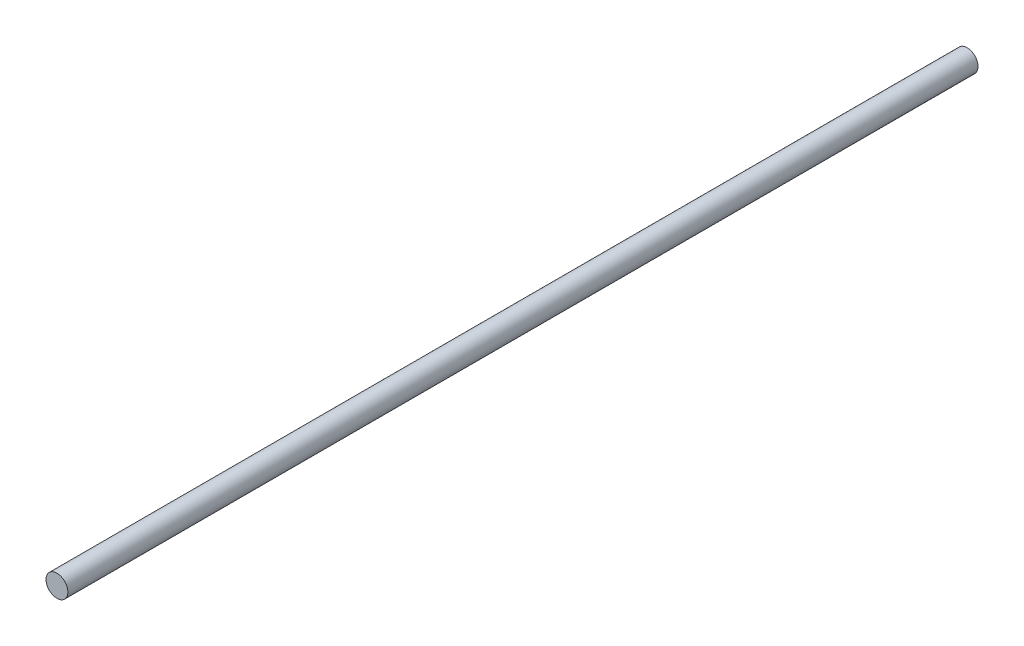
ISO-10303-21;
HEADER;
FILE_DESCRIPTION(('STEP AP214'),'2;1');
FILE_NAME('part.step','',(''),(''),'','','');
FILE_SCHEMA(('AUTOMOTIVE_DESIGN { 1 0 10303 214 1 1 1 1 }'));
ENDSEC;
DATA;
#1=APPLICATION_CONTEXT('core data for automotive mechanical design processes');
#2=APPLICATION_PROTOCOL_DEFINITION('international standard','automotive_design',2000,#1);
#3=PRODUCT_CONTEXT('',#1,'mechanical');
#4=PRODUCT('Part','Part','',(#3));
#5=PRODUCT_RELATED_PRODUCT_CATEGORY('part','',(#4));
#6=PRODUCT_DEFINITION_FORMATION('','',#4);
#7=PRODUCT_DEFINITION_CONTEXT('part definition',#1,'design');
#8=PRODUCT_DEFINITION('design','',#6,#7);
#9=PRODUCT_DEFINITION_SHAPE('','',#8);
#10=(LENGTH_UNIT() NAMED_UNIT(*) SI_UNIT(.MILLI.,.METRE.));
#11=(NAMED_UNIT(*) PLANE_ANGLE_UNIT() SI_UNIT($,.RADIAN.));
#12=(NAMED_UNIT(*) SI_UNIT($,.STERADIAN.) SOLID_ANGLE_UNIT());
#13=UNCERTAINTY_MEASURE_WITH_UNIT(LENGTH_MEASURE(1.E-05),#10,'distance_accuracy_value','');
#14=(GEOMETRIC_REPRESENTATION_CONTEXT(3) GLOBAL_UNCERTAINTY_ASSIGNED_CONTEXT((#13)) GLOBAL_UNIT_ASSIGNED_CONTEXT((#10,
#11,#12)) REPRESENTATION_CONTEXT('',''));
#15=CARTESIAN_POINT('',(0.,0.,0.));
#16=DIRECTION('',(0.,0.,1.));
#17=DIRECTION('',(1.,0.,0.));
#18=AXIS2_PLACEMENT_3D('',#15,#16,#17);
#19=CARTESIAN_POINT('',(0.,0.,990.));
#20=DIRECTION('',(0.,0.,-1.));
#21=DIRECTION('',(-1.,0.,0.));
#22=AXIS2_PLACEMENT_3D('',#19,#20,#21);
#23=CYLINDRICAL_SURFACE('',#22,12.);
#24=CARTESIAN_POINT('',(0.,0.,0.));
#25=DIRECTION('',(0.,0.,-1.));
#26=DIRECTION('',(-1.,0.,0.));
#27=AXIS2_PLACEMENT_3D('',#24,#25,#26);
#28=CIRCLE('',#27,12.);
#29=CARTESIAN_POINT('',(-12.,0.,0.));
#30=VERTEX_POINT('',#29);
#31=EDGE_CURVE('E8',#30,#30,#28,.T.);
#32=ORIENTED_EDGE('',*,*,#31,.F.);
#33=EDGE_LOOP('',(#32));
#34=FACE_BOUND('',#33,.T.);
#35=CARTESIAN_POINT('',(0.,0.,1000.));
#36=DIRECTION('',(0.,0.,-1.));
#37=DIRECTION('',(-1.,0.,0.));
#38=AXIS2_PLACEMENT_3D('',#35,#36,#37);
#39=CIRCLE('',#38,12.);
#40=CARTESIAN_POINT('',(-12.,0.,1000.));
#41=VERTEX_POINT('',#40);
#42=EDGE_CURVE('E18',#41,#41,#39,.T.);
#43=ORIENTED_EDGE('',*,*,#42,.T.);
#44=EDGE_LOOP('',(#43));
#45=FACE_BOUND('',#44,.T.);
#46=ADVANCED_FACE('F12',(#34,#45),#23,.T.);
#47=CARTESIAN_POINT('',(0.,0.,0.));
#48=DIRECTION('',(0.,0.,1.));
#49=DIRECTION('',(1.,0.,0.));
#50=AXIS2_PLACEMENT_3D('',#47,#48,#49);
#51=PLANE('',#50);
#52=ORIENTED_EDGE('',*,*,#31,.T.);
#53=EDGE_LOOP('',(#52));
#54=FACE_BOUND('',#53,.T.);
#55=ADVANCED_FACE('F27',(#54),#51,.F.);
#56=CARTESIAN_POINT('',(0.,0.,1000.));
#57=DIRECTION('',(0.,0.,-1.));
#58=DIRECTION('',(-1.,0.,0.));
#59=AXIS2_PLACEMENT_3D('',#56,#57,#58);
#60=PLANE('',#59);
#61=ORIENTED_EDGE('',*,*,#42,.F.);
#62=EDGE_LOOP('',(#61));
#63=FACE_BOUND('',#62,.T.);
#64=ADVANCED_FACE('F25',(#63),#60,.F.);
#65=CLOSED_SHELL('',(#46,#55,#64));
#66=MANIFOLD_SOLID_BREP('B1',#65);
#67=ADVANCED_BREP_SHAPE_REPRESENTATION('',(#18,#66),#14);
#68=SHAPE_DEFINITION_REPRESENTATION(#9,#67);
ENDSEC;
END-ISO-10303-21;
